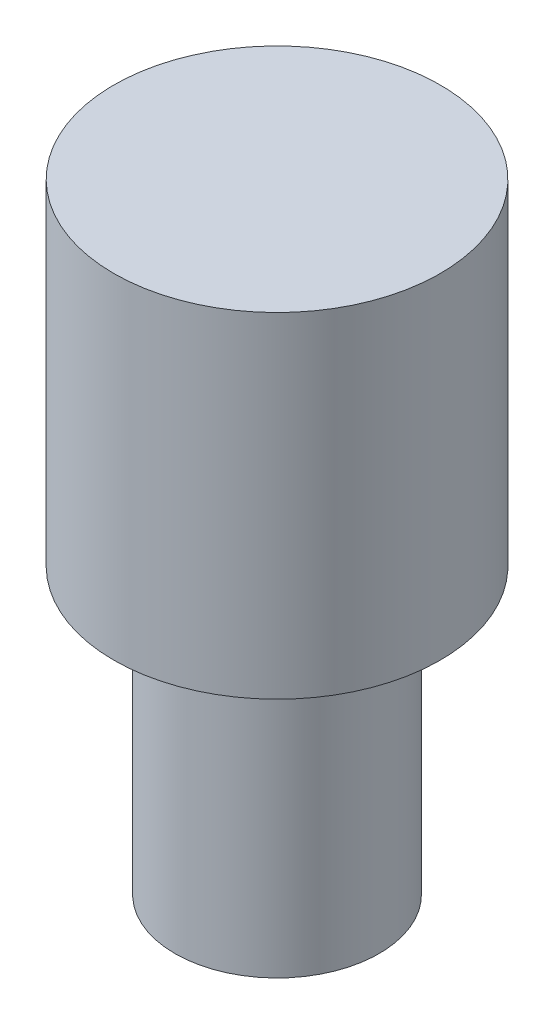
ISO-10303-21;
HEADER;
FILE_DESCRIPTION(('STEP AP214'),'2;1');
FILE_NAME('part.step','',(''),(''),'','','');
FILE_SCHEMA(('AUTOMOTIVE_DESIGN { 1 0 10303 214 1 1 1 1 }'));
ENDSEC;
DATA;
#1=APPLICATION_CONTEXT('core data for automotive mechanical design processes');
#2=APPLICATION_PROTOCOL_DEFINITION('international standard','automotive_design',2000,#1);
#3=PRODUCT_CONTEXT('',#1,'mechanical');
#4=PRODUCT('Part','Part','',(#3));
#5=PRODUCT_RELATED_PRODUCT_CATEGORY('part','',(#4));
#6=PRODUCT_DEFINITION_FORMATION('','',#4);
#7=PRODUCT_DEFINITION_CONTEXT('part definition',#1,'design');
#8=PRODUCT_DEFINITION('design','',#6,#7);
#9=PRODUCT_DEFINITION_SHAPE('','',#8);
#10=(LENGTH_UNIT() NAMED_UNIT(*) SI_UNIT(.MILLI.,.METRE.));
#11=(NAMED_UNIT(*) PLANE_ANGLE_UNIT() SI_UNIT($,.RADIAN.));
#12=(NAMED_UNIT(*) SI_UNIT($,.STERADIAN.) SOLID_ANGLE_UNIT());
#13=UNCERTAINTY_MEASURE_WITH_UNIT(LENGTH_MEASURE(1.E-05),#10,'distance_accuracy_value','');
#14=(GEOMETRIC_REPRESENTATION_CONTEXT(3) GLOBAL_UNCERTAINTY_ASSIGNED_CONTEXT((#13)) GLOBAL_UNIT_ASSIGNED_CONTEXT((#10,
#11,#12)) REPRESENTATION_CONTEXT('',''));
#15=CARTESIAN_POINT('',(0.,0.,0.));
#16=DIRECTION('',(0.,0.,1.));
#17=DIRECTION('',(1.,0.,0.));
#18=AXIS2_PLACEMENT_3D('',#15,#16,#17);
#19=CARTESIAN_POINT('',(0.,0.,0.));
#20=DIRECTION('',(0.,1.,0.));
#21=DIRECTION('',(0.,0.,1.));
#22=AXIS2_PLACEMENT_3D('',#19,#20,#21);
#23=PLANE('',#22);
#24=CARTESIAN_POINT('',(0.,0.,0.));
#25=DIRECTION('',(0.,1.,0.));
#26=DIRECTION('',(0.,0.,1.));
#27=AXIS2_PLACEMENT_3D('',#24,#25,#26);
#28=CIRCLE('',#27,3.9);
#29=CARTESIAN_POINT('',(0.,0.,3.9));
#30=VERTEX_POINT('',#29);
#31=EDGE_CURVE('E26',#30,#30,#28,.T.);
#32=ORIENTED_EDGE('',*,*,#31,.F.);
#33=EDGE_LOOP('',(#32));
#34=FACE_BOUND('',#33,.T.);
#35=CARTESIAN_POINT('',(0.,0.,0.));
#36=DIRECTION('',(0.,1.,0.));
#37=DIRECTION('',(0.,0.,1.));
#38=AXIS2_PLACEMENT_3D('',#35,#36,#37);
#39=CIRCLE('',#38,2.44);
#40=CARTESIAN_POINT('',(0.,0.,2.44));
#41=VERTEX_POINT('',#40);
#42=EDGE_CURVE('E10',#41,#41,#39,.F.);
#43=ORIENTED_EDGE('',*,*,#42,.F.);
#44=EDGE_LOOP('',(#43));
#45=FACE_BOUND('',#44,.T.);
#46=ADVANCED_FACE('F15',(#34,#45),#23,.F.);
#47=CARTESIAN_POINT('',(0.,8.,0.));
#48=DIRECTION('',(0.,-1.,0.));
#49=DIRECTION('',(0.,0.,-1.));
#50=AXIS2_PLACEMENT_3D('',#47,#48,#49);
#51=CYLINDRICAL_SURFACE('',#50,3.9);
#52=CARTESIAN_POINT('',(0.,8.,0.));
#53=DIRECTION('',(0.,1.,0.));
#54=DIRECTION('',(0.,0.,1.));
#55=AXIS2_PLACEMENT_3D('',#52,#53,#54);
#56=CIRCLE('',#55,3.9);
#57=CARTESIAN_POINT('',(0.,8.,3.9));
#58=VERTEX_POINT('',#57);
#59=EDGE_CURVE('E22',#58,#58,#56,.T.);
#60=ORIENTED_EDGE('',*,*,#59,.F.);
#61=EDGE_LOOP('',(#60));
#62=FACE_BOUND('',#61,.T.);
#63=ORIENTED_EDGE('',*,*,#31,.T.);
#64=EDGE_LOOP('',(#63));
#65=FACE_BOUND('',#64,.T.);
#66=ADVANCED_FACE('F17',(#62,#65),#51,.T.);
#67=CARTESIAN_POINT('',(0.,8.,0.));
#68=DIRECTION('',(0.,1.,0.));
#69=DIRECTION('',(0.,0.,1.));
#70=AXIS2_PLACEMENT_3D('',#67,#68,#69);
#71=PLANE('',#70);
#72=ORIENTED_EDGE('',*,*,#59,.T.);
#73=EDGE_LOOP('',(#72));
#74=FACE_BOUND('',#73,.T.);
#75=ADVANCED_FACE('F40',(#74),#71,.T.);
#76=CARTESIAN_POINT('',(0.,-6.8,0.));
#77=DIRECTION('',(0.,1.,0.));
#78=DIRECTION('',(0.,0.,1.));
#79=AXIS2_PLACEMENT_3D('',#76,#77,#78);
#80=CYLINDRICAL_SURFACE('',#79,2.44);
#81=CARTESIAN_POINT('',(0.,-6.8,0.));
#82=DIRECTION('',(0.,-1.,0.));
#83=DIRECTION('',(0.,0.,-1.));
#84=AXIS2_PLACEMENT_3D('',#81,#82,#83);
#85=CIRCLE('',#84,2.44);
#86=CARTESIAN_POINT('',(0.,-6.8,-2.44));
#87=VERTEX_POINT('',#86);
#88=EDGE_CURVE('E30',#87,#87,#85,.T.);
#89=ORIENTED_EDGE('',*,*,#88,.F.);
#90=EDGE_LOOP('',(#89));
#91=FACE_BOUND('',#90,.T.);
#92=ORIENTED_EDGE('',*,*,#42,.T.);
#93=EDGE_LOOP('',(#92));
#94=FACE_BOUND('',#93,.T.);
#95=ADVANCED_FACE('F38',(#91,#94),#80,.T.);
#96=CARTESIAN_POINT('',(0.,-6.8,0.));
#97=DIRECTION('',(0.,-1.,0.));
#98=DIRECTION('',(0.,0.,-1.));
#99=AXIS2_PLACEMENT_3D('',#96,#97,#98);
#100=PLANE('',#99);
#101=ORIENTED_EDGE('',*,*,#88,.T.);
#102=EDGE_LOOP('',(#101));
#103=FACE_BOUND('',#102,.T.);
#104=ADVANCED_FACE('F36',(#103),#100,.T.);
#105=CLOSED_SHELL('',(#46,#66,#75,#95,#104));
#106=MANIFOLD_SOLID_BREP('B1',#105);
#107=ADVANCED_BREP_SHAPE_REPRESENTATION('',(#18,#106),#14);
#108=SHAPE_DEFINITION_REPRESENTATION(#9,#107);
ENDSEC;
END-ISO-10303-21;
